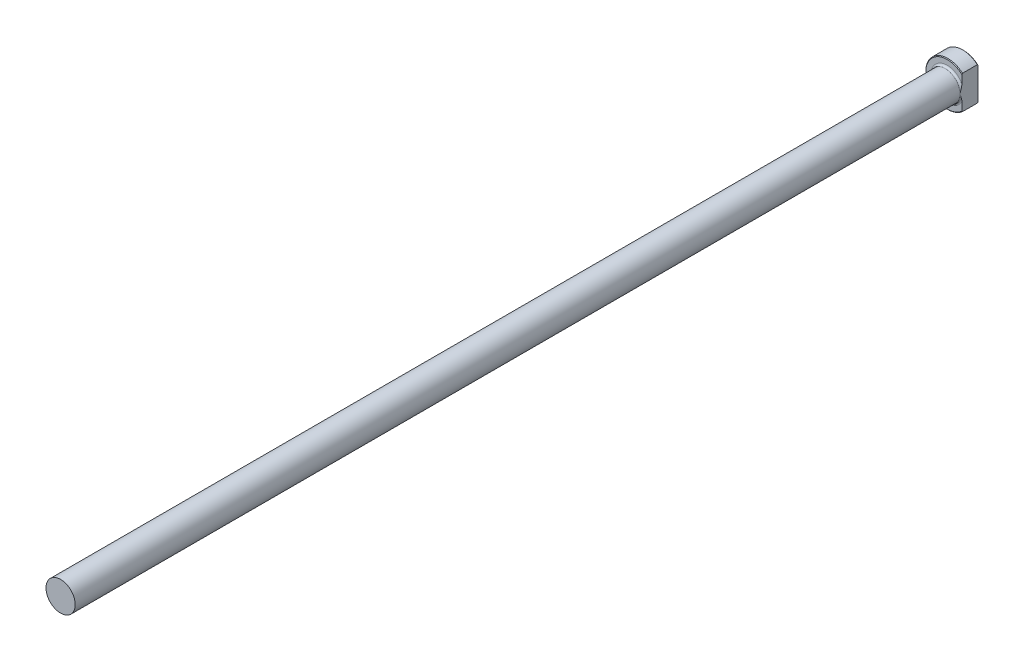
from build123d import *

# Parameters (mm, degrees)
CHAMFER1_SIZE      = 0.254
CUT_EXTRUDE1_REACH = 357.814


with BuildPart() as part:
    # Sketch1 → Revolve1 (revolve)
    with BuildSketch(Plane(origin=(0, 0, 0), x_dir=(0, 0, -1), z_dir=(1, 0, 0)), mode=Mode.PRIVATE) as revolve1_sk:
        with BuildLine():
            Line((0, 0), (0, 8.7249))
            Line((0, 8.7249), (-6.35, 8.7249))
            Line((-6.35, 8.7249), (-6.35, 6.51637))
            ThreePointArc((-6.35, 6.51637), (-6.573184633, 5.977554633), (-7.112, 5.75437))
            Line((-7.112, 5.75437), (-355.6, 5.75437))
            Line((-355.6, 5.75437), (-355.6, 0))
            Line((-355.6, 0), (0, 0))
        make_face()
    revolve(revolve1_sk.sketch.rotate(Axis((0, 0, -25.434744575), (0, 0, 1)), 90), axis=Axis((0, 0, -25.434744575), (0, 0, 1)))

    # Chamfer1
    chamfer1_edges = [part.edges().sort_by_distance(p)[0] for p in [
        (8.7249, 0, 0),
        (8.7249, 0, 6.35),
    ]]
    chamfer(chamfer1_edges, length=CHAMFER1_SIZE)

    # Sketch2 → Cut-Extrude1 (cut, up to next)
    with BuildSketch(Plane(origin=(0, 0, 0), x_dir=(-1, 0, 0), z_dir=(0, 0, -1)), mode=Mode.PRIVATE) as cut_extrude1_sk1:
        with BuildLine():
            Line((-5.75437, 6.558285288), (-5.75437, -6.558285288))
            ThreePointArc((-5.75437, -6.558285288), (-8.7249, 0), (-5.75437, 6.558285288))
        make_face()
    cut_extrude1_tool1 = extrude(cut_extrude1_sk1.sketch, amount=-CUT_EXTRUDE1_REACH, mode=Mode.PRIVATE) & part.part
    add(cut_extrude1_tool1.solids().sort_by_distance((6.961828, 0, 0))[0], mode=Mode.SUBTRACT)


solid = part.part
